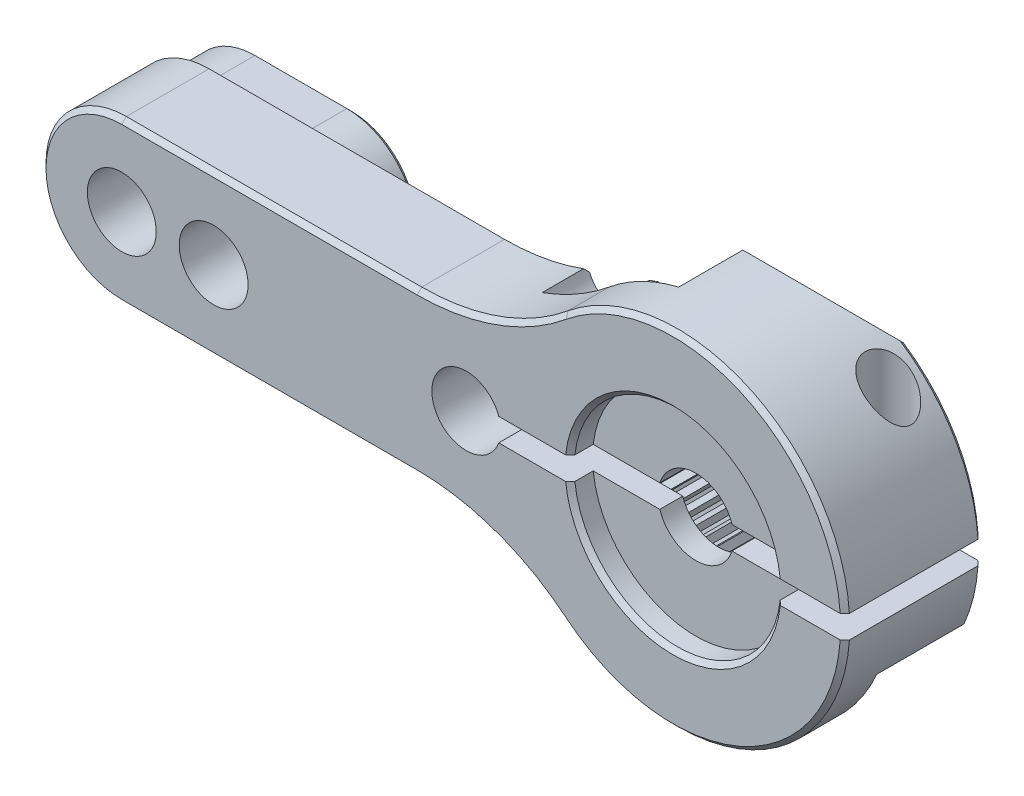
from build123d import *

# Parameters (mm, degrees)
ESQUISSE1_R                  = 1.65
ESQUISSE1_R_2                = 1.5
BOSS_EXTRU_1_DEPTH           = 6
ESQUISSE2_W                  = 18.914213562
ESQUISSE2_H                  = 1
ENL_V_MAT_EXTRU_1_DEPTH      = 6
ENL_V_MAT_EXTRU_2_DEPTH      = 2
ENL_V_MAT_EXTRU_3_DEPTH      = 4
ESQUISSE5_R                  = 1
ENL_V_MAT_EXTRU_4_DEPTH      = 31.041637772
ESQUISSE6_R                  = 1
ENL_V_MAT_EXTRU_5_DEPTH      = 31.041637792
ENL_V_MAT_EXTRU_6_DEPTH      = 10
ENL_V_MAT_EXTRU_6_DEPTH_BACK = 10
ESQUISSE8_R                  = 3
ENL_V_MAT_EXTRU_7_DEPTH      = 4
BOSS_EXTRU_2_DEPTH           = 4
R_P_TITION_CIRCULAIRE1_COUNT = 36
ESQUISSE10_W                 = 11.375009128
ESQUISSE10_H                 = 1
ENL_V_MAT_EXTRU_8_DEPTH      = 30.129023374
CHANFREIN1_SIZE              = 0.2
ESQUISSE11_R                 = 4.5
ENL_V_MAT_EXTRU_9_DEPTH      = 1
CHANFREIN2_SIZE              = 0.2


with BuildPart() as part:
    # Esquisse1 → Boss.-Extru.1 (new body)
    with BuildSketch(Plane.XY):
        with BuildLine():
            Line((-11.135528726, 3.5), (-24, 3.5))
            ThreePointArc((-24, 3.5), (-27.5, 0), (-24, -3.5))
            Line((-24, -3.5), (-11.135528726, -3.5))
            ThreePointArc((-11.135528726, -3.5), (-7.754911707, -4.088760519), (-4.772369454, -5.785714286))
            ThreePointArc((-4.772369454, -5.785714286), (7.5, 0), (-4.772369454, 5.785714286))
            ThreePointArc((-4.772369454, 5.785714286), (-7.754911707, 4.088760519), (-11.135528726, 3.5))
        make_face()
        Circle(ESQUISSE1_R, mode=Mode.SUBTRACT)
        with Locations((-9, 0)):
            Circle(ESQUISSE1_R_2, mode=Mode.SUBTRACT)
        with Locations((-24, 0)):
            Circle(ESQUISSE1_R_2, mode=Mode.SUBTRACT)
        with Locations((-20, 0)):
            Circle(ESQUISSE1_R_2, mode=Mode.SUBTRACT)
    extrude(amount=BOSS_EXTRU_1_DEPTH)

    # Esquisse2 → Enl_v. mat.-Extru.1 (cut)
    with BuildSketch(Plane.XY.offset(6)):
        with Locations((-0.957106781, 0)):
            Rectangle(ESQUISSE2_W, ESQUISSE2_H)
    extrude(amount=-ENL_V_MAT_EXTRU_1_DEPTH, mode=Mode.SUBTRACT)

    # Esquisse3 → Enl_v. mat.-Extru.2 (cut)
    with BuildSketch(Plane(origin=(0, 0, 0), x_dir=(-1, 0, 0), z_dir=(0, 0, -1))):
        with BuildLine():
            Line((24, -3.5), (11.135528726, -3.5))
            ThreePointArc((11.135528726, -3.5), (7.754911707, -4.088760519), (4.772369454, -5.785714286))
            ThreePointArc((4.772369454, -5.785714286), (7.5, 0), (4.772369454, 5.785714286))
            ThreePointArc((4.772369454, 5.785714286), (7.754911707, 4.088760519), (11.135528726, 3.5))
            Line((11.135528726, 3.5), (24, 3.5))
            ThreePointArc((24, 3.5), (27.5, 0), (24, -3.5))
        make_face()
        with BuildLine():
            Line((24, -3), (20, -3))
            ThreePointArc((20, -3), (17, 0), (20, 3))
            Line((20, 3), (24, 3))
            ThreePointArc((24, 3), (27, 0), (24, -3))
        make_face(mode=Mode.SUBTRACT)
    extrude(amount=-ENL_V_MAT_EXTRU_2_DEPTH, mode=Mode.SUBTRACT)

    # Esquisse4 → Enl_v. mat.-Extru.3 (cut)
    with BuildSketch(Plane(origin=(0, 0, 0), x_dir=(-1, 0, 0), z_dir=(0, 0, -1))):
        with BuildLine():
            Line((-7.5, -3), (-3.25, -3))
            ThreePointArc((-3.25, -3), (-2.189339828, -3.439339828), (-1.75, -4.5))
            Line((-1.75, -4.5), (-1.75, -7.5))
            Line((-1.75, -7.5), (-7.5, -7.5))
            Line((-7.5, -7.5), (-7.5, -3))
        make_face()
        with BuildLine():
            Line((1.75, 7.5), (7.75, 7.5))
            Line((7.75, 7.5), (7.75, 4.5))
            ThreePointArc((7.75, 4.5), (7.310660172, 3.439339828), (6.25, 3))
            Line((6.25, 3), (3.25, 3))
            ThreePointArc((3.25, 3), (2.189339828, 3.439339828), (1.75, 4.5))
            Line((1.75, 4.5), (1.75, 7.5))
        make_face()
    extrude(amount=-ENL_V_MAT_EXTRU_3_DEPTH, mode=Mode.SUBTRACT)

    # Esquisse5 → Enl_v. mat.-Extru.4 (cut, through all)
    with BuildSketch(Plane.XZ.offset(3)):
        with Locations((4.873863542, 1.5)):
            Circle(ESQUISSE5_R)
    extrude(amount=-ENL_V_MAT_EXTRU_4_DEPTH, mode=Mode.SUBTRACT)

    # Esquisse6 → Enl_v. mat.-Extru.5 (cut, through all)
    with BuildSketch(Plane(origin=(0, 3, 0), x_dir=(1, 0, 0), z_dir=(0, 1, 0))):
        with Locations(Location((-5.233314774, -1.5, 0), (0, 0, 270))):
            Circle(ESQUISSE6_R)
    extrude(amount=-ENL_V_MAT_EXTRU_5_DEPTH, mode=Mode.SUBTRACT)

    # Esquisse7 → Enl_v. mat.-Extru.6 (cut, two sides: drawn at the far end of the back side and taken through both)
    with BuildSketch(Plane(origin=(0, 0, 0), x_dir=(0, 0, -1), z_dir=(1, 0, 0)).offset(-ENL_V_MAT_EXTRU_6_DEPTH_BACK)):
        Polygon((-1.414213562, 7.5), (0, 6.085786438), (0, 7.5), align=None)
        Polygon((0, -6.085786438), (-1.414213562, -7.5), (0, -7.5), align=None)
    extrude(amount=ENL_V_MAT_EXTRU_6_DEPTH + ENL_V_MAT_EXTRU_6_DEPTH_BACK, mode=Mode.SUBTRACT)

    # Esquisse8 → Enl_v. mat.-Extru.7 (cut)
    with BuildSketch(Plane(origin=(0, 0, 0), x_dir=(-1, 0, 0), z_dir=(0, 0, -1))):
        Circle(ESQUISSE8_R)
    extrude(amount=-ENL_V_MAT_EXTRU_7_DEPTH, mode=Mode.SUBTRACT)

    # Esquisse9 → Boss.-Extru.2 (add)
    with BuildSketch(Plane(origin=(0, 0, 0), x_dir=(-1, 0, 0), z_dir=(0, 0, -1))):
        Polygon((-0.202072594, 3), (0, 2.65), (0.202072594, 3), align=None)
    boss_extru_2 = extrude(amount=-BOSS_EXTRU_2_DEPTH)

    # R_p_tition circulaire1: Boss.-Extru.2 ×36 about axis, 2 skipped
    r_p_tition_circulaire1_axis = Axis((0, 0, 0), (0, 0, -1))
    add([boss_extru_2.rotate(r_p_tition_circulaire1_axis, i * 360 / R_P_TITION_CIRCULAIRE1_COUNT) for i in range(1, R_P_TITION_CIRCULAIRE1_COUNT) if i not in (9, 27)])

    # Esquisse10 → Enl_v. mat.-Extru.8 (cut, through all)
    with BuildSketch(Plane(origin=(0, 0, 0), x_dir=(-1, 0, 0), z_dir=(0, 0, -1))):
        with Locations((-1.79581021, 0)):
            Rectangle(ESQUISSE10_W, ESQUISSE10_H)
    extrude(amount=-ENL_V_MAT_EXTRU_8_DEPTH, mode=Mode.SUBTRACT)

    # Chanfrein1
    chanfrein1_edges = [part.edges().sort_by_distance(p)[0] for p in [
        (-22, 3, 0),
        (-7.271599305, 1.836802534, 0),
        (7.28660705, -1.776332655, 0),
        (-7.754911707, -4.088760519, 6),
        (2.970185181, -6.886798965, 6),
        (-8.527137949, -3.84617705, 2),
        (-7.754911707, 4.088760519, 6),
        (-17.567764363, 3.5, 6),
        (6.557767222, 3.639462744, 0),
        (2.970185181, 6.886798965, 6),
        (-27.5, 0, 6),
        (-6.557767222, -3.639462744, 0),
        (-17.567764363, -3.5, 6),
        (-9.39008473, 3.653506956, 2),
        (-17.567764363, 3.5, 2),
        (-27.5, 0, 2),
        (-17.567764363, -3.5, 2),
        (-27, 0, 0),
        (-17, 0, 0),
    ]]
    chamfer(chanfrein1_edges, length=CHANFREIN1_SIZE)

    # Esquisse11 → Enl_v. mat.-Extru.9 (cut)
    with BuildSketch(Plane.XY.offset(6)):
        Circle(ESQUISSE11_R)
    extrude(amount=-ENL_V_MAT_EXTRU_9_DEPTH, mode=Mode.SUBTRACT)

    # Chanfrein2
    chanfrein2_edges = [part.edges().sort_by_distance(p)[0] for p in [
        (0, 4.5, 6),
        (0, -4.5, 6),
    ]]
    chamfer(chanfrein2_edges, length=CHANFREIN2_SIZE)


solid = part.part
